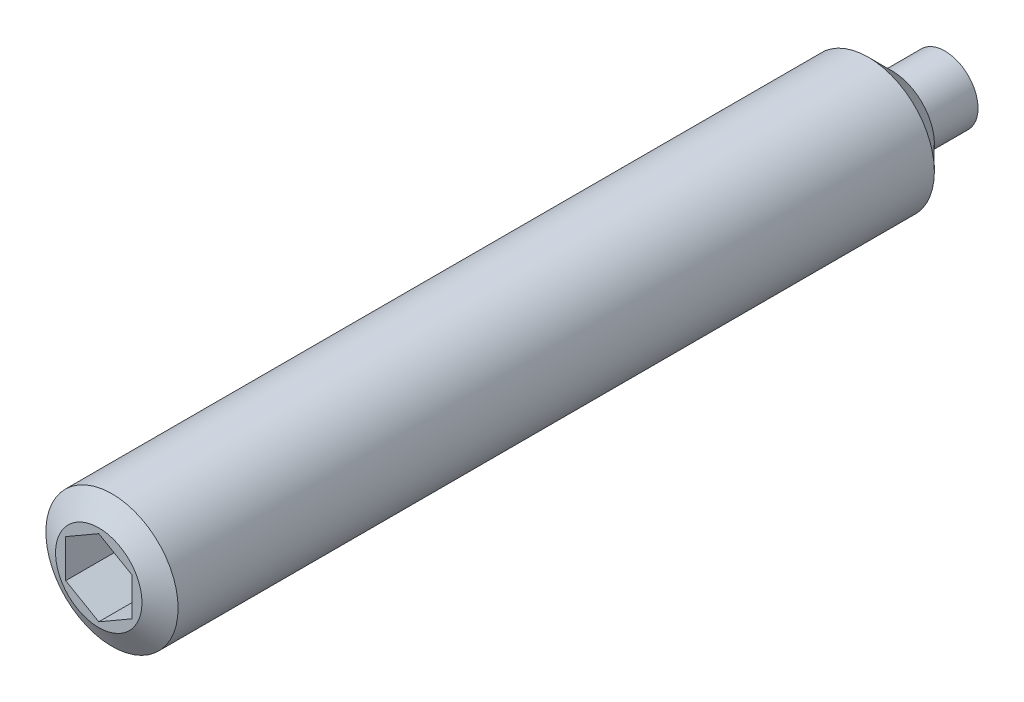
ISO-10303-21;
HEADER;
FILE_DESCRIPTION(('STEP AP214'),'2;1');
FILE_NAME('part.step','',(''),(''),'','','');
FILE_SCHEMA(('AUTOMOTIVE_DESIGN { 1 0 10303 214 1 1 1 1 }'));
ENDSEC;
DATA;
#1=APPLICATION_CONTEXT('core data for automotive mechanical design processes');
#2=APPLICATION_PROTOCOL_DEFINITION('international standard','automotive_design',2000,#1);
#3=PRODUCT_CONTEXT('',#1,'mechanical');
#4=PRODUCT('Part','Part','',(#3));
#5=PRODUCT_RELATED_PRODUCT_CATEGORY('part','',(#4));
#6=PRODUCT_DEFINITION_FORMATION('','',#4);
#7=PRODUCT_DEFINITION_CONTEXT('part definition',#1,'design');
#8=PRODUCT_DEFINITION('design','',#6,#7);
#9=PRODUCT_DEFINITION_SHAPE('','',#8);
#10=(LENGTH_UNIT() NAMED_UNIT(*) SI_UNIT(.MILLI.,.METRE.));
#11=(NAMED_UNIT(*) PLANE_ANGLE_UNIT() SI_UNIT($,.RADIAN.));
#12=(NAMED_UNIT(*) SI_UNIT($,.STERADIAN.) SOLID_ANGLE_UNIT());
#13=UNCERTAINTY_MEASURE_WITH_UNIT(LENGTH_MEASURE(1.E-05),#10,'distance_accuracy_value','');
#14=(GEOMETRIC_REPRESENTATION_CONTEXT(3) GLOBAL_UNCERTAINTY_ASSIGNED_CONTEXT((#13)) GLOBAL_UNIT_ASSIGNED_CONTEXT((#10,
#11,#12)) REPRESENTATION_CONTEXT('',''));
#15=CARTESIAN_POINT('',(0.,0.,0.));
#16=DIRECTION('',(0.,0.,1.));
#17=DIRECTION('',(1.,0.,0.));
#18=AXIS2_PLACEMENT_3D('',#15,#16,#17);
#19=CARTESIAN_POINT('',(1.25,0.,0.));
#20=DIRECTION('',(0.,0.,-1.));
#21=DIRECTION('',(-1.,0.,0.));
#22=AXIS2_PLACEMENT_3D('',#19,#20,#21);
#23=PLANE('',#22);
#24=CARTESIAN_POINT('',(0.,0.,0.));
#25=DIRECTION('',(0.,0.,1.));
#26=DIRECTION('',(1.,0.,0.));
#27=AXIS2_PLACEMENT_3D('',#24,#25,#26);
#28=CIRCLE('',#27,1.25);
#29=CARTESIAN_POINT('',(1.25,0.,0.));
#30=VERTEX_POINT('',#29);
#31=EDGE_CURVE('E124',#30,#30,#28,.T.);
#32=ORIENTED_EDGE('',*,*,#31,.F.);
#33=EDGE_LOOP('',(#32));
#34=FACE_BOUND('',#33,.T.);
#35=ADVANCED_FACE('F14',(#34),#23,.T.);
#36=CARTESIAN_POINT('',(0.,0.,52.));
#37=DIRECTION('',(0.,0.,1.));
#38=DIRECTION('',(1.,0.,0.));
#39=AXIS2_PLACEMENT_3D('',#36,#37,#38);
#40=CYLINDRICAL_SURFACE('',#39,1.25);
#41=CARTESIAN_POINT('',(0.,0.,2.));
#42=DIRECTION('',(0.,0.,1.));
#43=DIRECTION('',(1.,0.,0.));
#44=AXIS2_PLACEMENT_3D('',#41,#42,#43);
#45=CIRCLE('',#44,1.25);
#46=CARTESIAN_POINT('',(1.25,0.,2.));
#47=VERTEX_POINT('',#46);
#48=EDGE_CURVE('E121',#47,#47,#45,.T.);
#49=ORIENTED_EDGE('',*,*,#48,.F.);
#50=EDGE_LOOP('',(#49));
#51=FACE_BOUND('',#50,.T.);
#52=ORIENTED_EDGE('',*,*,#31,.T.);
#53=EDGE_LOOP('',(#52));
#54=FACE_BOUND('',#53,.T.);
#55=ADVANCED_FACE('F149',(#51,#54),#40,.T.);
#56=CARTESIAN_POINT('',(2.5,0.,2.));
#57=DIRECTION('',(0.,0.,-1.));
#58=DIRECTION('',(-1.,0.,0.));
#59=AXIS2_PLACEMENT_3D('',#56,#57,#58);
#60=PLANE('',#59);
#61=CARTESIAN_POINT('',(0.,0.,2.));
#62=DIRECTION('',(0.,0.,-1.));
#63=DIRECTION('',(-1.,0.,0.));
#64=AXIS2_PLACEMENT_3D('',#61,#62,#63);
#65=CIRCLE('',#64,1.6);
#66=CARTESIAN_POINT('',(-1.6,0.,2.));
#67=VERTEX_POINT('',#66);
#68=EDGE_CURVE('E130',#67,#67,#65,.T.);
#69=ORIENTED_EDGE('',*,*,#68,.T.);
#70=EDGE_LOOP('',(#69));
#71=FACE_BOUND('',#70,.T.);
#72=ORIENTED_EDGE('',*,*,#48,.T.);
#73=EDGE_LOOP('',(#72));
#74=FACE_BOUND('',#73,.T.);
#75=ADVANCED_FACE('F155',(#71,#74),#60,.T.);
#76=CARTESIAN_POINT('',(0.,0.,52.));
#77=DIRECTION('',(0.,0.,1.));
#78=DIRECTION('',(1.,0.,0.));
#79=AXIS2_PLACEMENT_3D('',#76,#77,#78);
#80=CYLINDRICAL_SURFACE('',#79,2.5);
#81=CARTESIAN_POINT('',(0.,0.,31.5));
#82=DIRECTION('',(0.,0.,1.));
#83=DIRECTION('',(1.,0.,0.));
#84=AXIS2_PLACEMENT_3D('',#81,#82,#83);
#85=CIRCLE('',#84,2.5);
#86=CARTESIAN_POINT('',(2.5,0.,31.5));
#87=VERTEX_POINT('',#86);
#88=EDGE_CURVE('E9',#87,#87,#85,.F.);
#89=ORIENTED_EDGE('',*,*,#88,.T.);
#90=EDGE_LOOP('',(#89));
#91=FACE_BOUND('',#90,.T.);
#92=CARTESIAN_POINT('',(0.,0.,2.9));
#93=DIRECTION('',(0.,0.,-1.));
#94=DIRECTION('',(-1.,0.,0.));
#95=AXIS2_PLACEMENT_3D('',#92,#93,#94);
#96=CIRCLE('',#95,2.5);
#97=CARTESIAN_POINT('',(-2.5,0.,2.9));
#98=VERTEX_POINT('',#97);
#99=EDGE_CURVE('E127',#98,#98,#96,.F.);
#100=ORIENTED_EDGE('',*,*,#99,.T.);
#101=EDGE_LOOP('',(#100));
#102=FACE_BOUND('',#101,.T.);
#103=ADVANCED_FACE('F162',(#91,#102),#80,.T.);
#104=CARTESIAN_POINT('',(0.,0.,32.));
#105=DIRECTION('',(0.,0.,1.));
#106=DIRECTION('',(1.,0.,0.));
#107=AXIS2_PLACEMENT_3D('',#104,#105,#106);
#108=PLANE('',#107);
#109=CARTESIAN_POINT('',(0.,0.,32.));
#110=DIRECTION('',(0.,0.,1.));
#111=DIRECTION('',(1.,0.,0.));
#112=AXIS2_PLACEMENT_3D('',#109,#110,#111);
#113=CIRCLE('',#112,1.63397459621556);
#114=CARTESIAN_POINT('',(1.63397459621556,0.,32.));
#115=VERTEX_POINT('',#114);
#116=EDGE_CURVE('E22',#115,#115,#113,.T.);
#117=ORIENTED_EDGE('',*,*,#116,.T.);
#118=EDGE_LOOP('',(#117));
#119=FACE_BOUND('',#118,.T.);
#120=DIRECTION('',(0.86602540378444,-0.5,0.));
#121=VECTOR('',#120,1.);
#122=CARTESIAN_POINT('',(-1.25,-0.721687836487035,32.));
#123=LINE('',#122,#121);
#124=CARTESIAN_POINT('',(-1.25,-0.721687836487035,32.));
#125=VERTEX_POINT('',#124);
#126=CARTESIAN_POINT('',(0.,-1.44337567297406,32.));
#127=VERTEX_POINT('',#126);
#128=EDGE_CURVE('E29',#125,#127,#123,.T.);
#129=ORIENTED_EDGE('',*,*,#128,.F.);
#130=DIRECTION('',(0.,-1.,0.));
#131=VECTOR('',#130,1.);
#132=CARTESIAN_POINT('',(-1.25,0.721687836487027,32.));
#133=LINE('',#132,#131);
#134=CARTESIAN_POINT('',(-1.25,0.721687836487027,32.));
#135=VERTEX_POINT('',#134);
#136=EDGE_CURVE('E97',#135,#125,#133,.T.);
#137=ORIENTED_EDGE('',*,*,#136,.F.);
#138=DIRECTION('',(0.866025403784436,0.5,0.));
#139=VECTOR('',#138,1.);
#140=CARTESIAN_POINT('',(-1.25,0.721687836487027,32.));
#141=LINE('',#140,#139);
#142=CARTESIAN_POINT('',(0.,1.44337567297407,32.));
#143=VERTEX_POINT('',#142);
#144=EDGE_CURVE('E92',#135,#143,#141,.T.);
#145=ORIENTED_EDGE('',*,*,#144,.T.);
#146=DIRECTION('',(-0.866025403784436,0.5,0.));
#147=VECTOR('',#146,1.);
#148=CARTESIAN_POINT('',(1.25,0.721687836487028,32.));
#149=LINE('',#148,#147);
#150=CARTESIAN_POINT('',(1.25,0.721687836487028,32.));
#151=VERTEX_POINT('',#150);
#152=EDGE_CURVE('E90',#151,#143,#149,.T.);
#153=ORIENTED_EDGE('',*,*,#152,.F.);
#154=DIRECTION('',(0.,-1.,0.));
#155=VECTOR('',#154,1.);
#156=CARTESIAN_POINT('',(1.25,0.721687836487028,32.));
#157=LINE('',#156,#155);
#158=CARTESIAN_POINT('',(1.25,-0.721687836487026,32.));
#159=VERTEX_POINT('',#158);
#160=EDGE_CURVE('E72',#151,#159,#157,.T.);
#161=ORIENTED_EDGE('',*,*,#160,.T.);
#162=DIRECTION('',(-0.866025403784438,-0.5,0.));
#163=VECTOR('',#162,1.);
#164=CARTESIAN_POINT('',(1.25,-0.721687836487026,32.));
#165=LINE('',#164,#163);
#166=EDGE_CURVE('E83',#159,#127,#165,.T.);
#167=ORIENTED_EDGE('',*,*,#166,.T.);
#168=EDGE_LOOP('',(#129,#137,#145,#153,#161,#167));
#169=FACE_BOUND('',#168,.T.);
#170=ADVANCED_FACE('F87',(#119,#169),#108,.T.);
#171=CARTESIAN_POINT('',(-1.25,-0.721687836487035,29.5));
#172=DIRECTION('',(-0.5,-0.86602540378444,0.));
#173=DIRECTION('',(-0.86602540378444,0.5,0.));
#174=AXIS2_PLACEMENT_3D('',#171,#172,#173);
#175=PLANE('',#174);
#176=DIRECTION('',(0.,0.,1.));
#177=VECTOR('',#176,1.);
#178=CARTESIAN_POINT('',(-1.25,-0.721687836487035,29.5));
#179=LINE('',#178,#177);
#180=CARTESIAN_POINT('',(-1.25,-0.721687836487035,29.5));
#181=VERTEX_POINT('',#180);
#182=EDGE_CURVE('E36',#181,#125,#179,.T.);
#183=ORIENTED_EDGE('',*,*,#182,.T.);
#184=ORIENTED_EDGE('',*,*,#128,.T.);
#185=DIRECTION('',(0.,0.,1.));
#186=VECTOR('',#185,1.);
#187=CARTESIAN_POINT('',(0.,-1.44337567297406,29.5));
#188=LINE('',#187,#186);
#189=CARTESIAN_POINT('',(0.,-1.44337567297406,29.5));
#190=VERTEX_POINT('',#189);
#191=EDGE_CURVE('E80',#190,#127,#188,.T.);
#192=ORIENTED_EDGE('',*,*,#191,.F.);
#193=DIRECTION('',(0.86602540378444,-0.5,0.));
#194=VECTOR('',#193,1.);
#195=CARTESIAN_POINT('',(-1.25,-0.721687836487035,29.5));
#196=LINE('',#195,#194);
#197=EDGE_CURVE('E99',#181,#190,#196,.T.);
#198=ORIENTED_EDGE('',*,*,#197,.F.);
#199=EDGE_LOOP('',(#183,#184,#192,#198));
#200=FACE_BOUND('',#199,.T.);
#201=ADVANCED_FACE('F169',(#200),#175,.F.);
#202=CARTESIAN_POINT('',(-1.25,0.721687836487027,29.5));
#203=DIRECTION('',(-1.,0.,0.));
#204=DIRECTION('',(0.,1.,0.));
#205=AXIS2_PLACEMENT_3D('',#202,#203,#204);
#206=PLANE('',#205);
#207=DIRECTION('',(0.,0.,1.));
#208=VECTOR('',#207,1.);
#209=CARTESIAN_POINT('',(-1.25,0.721687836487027,29.5));
#210=LINE('',#209,#208);
#211=CARTESIAN_POINT('',(-1.25,0.721687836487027,29.5));
#212=VERTEX_POINT('',#211);
#213=EDGE_CURVE('E118',#212,#135,#210,.T.);
#214=ORIENTED_EDGE('',*,*,#213,.T.);
#215=ORIENTED_EDGE('',*,*,#136,.T.);
#216=ORIENTED_EDGE('',*,*,#182,.F.);
#217=DIRECTION('',(0.,-1.,0.));
#218=VECTOR('',#217,1.);
#219=CARTESIAN_POINT('',(-1.25,0.721687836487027,29.5));
#220=LINE('',#219,#218);
#221=EDGE_CURVE('E111',#212,#181,#220,.T.);
#222=ORIENTED_EDGE('',*,*,#221,.F.);
#223=EDGE_LOOP('',(#214,#215,#216,#222));
#224=FACE_BOUND('',#223,.T.);
#225=ADVANCED_FACE('F170',(#224),#206,.F.);
#226=CARTESIAN_POINT('',(-1.25,0.721687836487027,29.5));
#227=DIRECTION('',(0.5,-0.866025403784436,0.));
#228=DIRECTION('',(-0.866025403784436,-0.5,0.));
#229=AXIS2_PLACEMENT_3D('',#226,#227,#228);
#230=PLANE('',#229);
#231=DIRECTION('',(0.,0.,1.));
#232=VECTOR('',#231,1.);
#233=CARTESIAN_POINT('',(0.,1.44337567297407,29.5));
#234=LINE('',#233,#232);
#235=CARTESIAN_POINT('',(0.,1.44337567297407,29.5));
#236=VERTEX_POINT('',#235);
#237=EDGE_CURVE('E116',#236,#143,#234,.T.);
#238=ORIENTED_EDGE('',*,*,#237,.T.);
#239=ORIENTED_EDGE('',*,*,#144,.F.);
#240=ORIENTED_EDGE('',*,*,#213,.F.);
#241=DIRECTION('',(0.866025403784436,0.5,0.));
#242=VECTOR('',#241,1.);
#243=CARTESIAN_POINT('',(-1.25,0.721687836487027,29.5));
#244=LINE('',#243,#242);
#245=EDGE_CURVE('E108',#212,#236,#244,.T.);
#246=ORIENTED_EDGE('',*,*,#245,.T.);
#247=EDGE_LOOP('',(#238,#239,#240,#246));
#248=FACE_BOUND('',#247,.T.);
#249=ADVANCED_FACE('F173',(#248),#230,.T.);
#250=CARTESIAN_POINT('',(1.25,0.721687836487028,29.5));
#251=DIRECTION('',(0.5,0.866025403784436,0.));
#252=DIRECTION('',(0.866025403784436,-0.5,0.));
#253=AXIS2_PLACEMENT_3D('',#250,#251,#252);
#254=PLANE('',#253);
#255=DIRECTION('',(0.,0.,1.));
#256=VECTOR('',#255,1.);
#257=CARTESIAN_POINT('',(1.25,0.721687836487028,29.5));
#258=LINE('',#257,#256);
#259=CARTESIAN_POINT('',(1.25,0.721687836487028,29.5));
#260=VERTEX_POINT('',#259);
#261=EDGE_CURVE('E79',#260,#151,#258,.T.);
#262=ORIENTED_EDGE('',*,*,#261,.T.);
#263=ORIENTED_EDGE('',*,*,#152,.T.);
#264=ORIENTED_EDGE('',*,*,#237,.F.);
#265=DIRECTION('',(-0.866025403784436,0.5,0.));
#266=VECTOR('',#265,1.);
#267=CARTESIAN_POINT('',(1.25,0.721687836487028,29.5));
#268=LINE('',#267,#266);
#269=EDGE_CURVE('E105',#260,#236,#268,.T.);
#270=ORIENTED_EDGE('',*,*,#269,.F.);
#271=EDGE_LOOP('',(#262,#263,#264,#270));
#272=FACE_BOUND('',#271,.T.);
#273=ADVANCED_FACE('F176',(#272),#254,.F.);
#274=CARTESIAN_POINT('',(1.25,0.721687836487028,29.5));
#275=DIRECTION('',(-1.,0.,0.));
#276=DIRECTION('',(0.,1.,0.));
#277=AXIS2_PLACEMENT_3D('',#274,#275,#276);
#278=PLANE('',#277);
#279=DIRECTION('',(0.,0.,1.));
#280=VECTOR('',#279,1.);
#281=CARTESIAN_POINT('',(1.25,-0.721687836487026,29.5));
#282=LINE('',#281,#280);
#283=CARTESIAN_POINT('',(1.25,-0.721687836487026,29.5));
#284=VERTEX_POINT('',#283);
#285=EDGE_CURVE('E68',#284,#159,#282,.T.);
#286=ORIENTED_EDGE('',*,*,#285,.T.);
#287=ORIENTED_EDGE('',*,*,#160,.F.);
#288=ORIENTED_EDGE('',*,*,#261,.F.);
#289=DIRECTION('',(0.,-1.,0.));
#290=VECTOR('',#289,1.);
#291=CARTESIAN_POINT('',(1.25,0.721687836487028,29.5));
#292=LINE('',#291,#290);
#293=EDGE_CURVE('E75',#260,#284,#292,.T.);
#294=ORIENTED_EDGE('',*,*,#293,.T.);
#295=EDGE_LOOP('',(#286,#287,#288,#294));
#296=FACE_BOUND('',#295,.T.);
#297=ADVANCED_FACE('F70',(#296),#278,.T.);
#298=CARTESIAN_POINT('',(1.25,-0.721687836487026,29.5));
#299=DIRECTION('',(-0.5,0.866025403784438,0.));
#300=DIRECTION('',(0.866025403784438,0.5,0.));
#301=AXIS2_PLACEMENT_3D('',#298,#299,#300);
#302=PLANE('',#301);
#303=DIRECTION('',(-0.866025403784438,-0.5,0.));
#304=VECTOR('',#303,1.);
#305=CARTESIAN_POINT('',(1.25,-0.721687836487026,29.5));
#306=LINE('',#305,#304);
#307=EDGE_CURVE('E102',#284,#190,#306,.T.);
#308=ORIENTED_EDGE('',*,*,#307,.T.);
#309=ORIENTED_EDGE('',*,*,#191,.T.);
#310=ORIENTED_EDGE('',*,*,#166,.F.);
#311=ORIENTED_EDGE('',*,*,#285,.F.);
#312=EDGE_LOOP('',(#308,#309,#310,#311));
#313=FACE_BOUND('',#312,.T.);
#314=ADVANCED_FACE('F84',(#313),#302,.T.);
#315=CARTESIAN_POINT('',(1.25,-2.16506350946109,29.5));
#316=DIRECTION('',(0.,0.,-1.));
#317=DIRECTION('',(-1.,0.,0.));
#318=AXIS2_PLACEMENT_3D('',#315,#316,#317);
#319=PLANE('',#318);
#320=ORIENTED_EDGE('',*,*,#197,.T.);
#321=ORIENTED_EDGE('',*,*,#307,.F.);
#322=ORIENTED_EDGE('',*,*,#293,.F.);
#323=ORIENTED_EDGE('',*,*,#269,.T.);
#324=ORIENTED_EDGE('',*,*,#245,.F.);
#325=ORIENTED_EDGE('',*,*,#221,.T.);
#326=EDGE_LOOP('',(#320,#321,#322,#323,#324,#325));
#327=FACE_BOUND('',#326,.T.);
#328=ADVANCED_FACE('F144',(#327),#319,.F.);
#329=CARTESIAN_POINT('',(0.,0.,2.9));
#330=DIRECTION('',(0.,0.,1.));
#331=DIRECTION('',(1.,0.,0.));
#332=AXIS2_PLACEMENT_3D('',#329,#330,#331);
#333=CONICAL_SURFACE('',#332,2.5,0.785398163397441);
#334=ORIENTED_EDGE('',*,*,#68,.F.);
#335=EDGE_LOOP('',(#334));
#336=FACE_BOUND('',#335,.T.);
#337=ORIENTED_EDGE('',*,*,#99,.F.);
#338=EDGE_LOOP('',(#337));
#339=FACE_BOUND('',#338,.T.);
#340=ADVANCED_FACE('F137',(#336,#339),#333,.T.);
#341=CARTESIAN_POINT('',(0.,0.,32.));
#342=DIRECTION('',(0.,0.,-1.));
#343=DIRECTION('',(-1.,0.,0.));
#344=AXIS2_PLACEMENT_3D('',#341,#342,#343);
#345=CONICAL_SURFACE('',#344,1.63397459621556,1.0471975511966);
#346=ORIENTED_EDGE('',*,*,#88,.F.);
#347=EDGE_LOOP('',(#346));
#348=FACE_BOUND('',#347,.T.);
#349=ORIENTED_EDGE('',*,*,#116,.F.);
#350=EDGE_LOOP('',(#349));
#351=FACE_BOUND('',#350,.T.);
#352=ADVANCED_FACE('F16',(#348,#351),#345,.T.);
#353=CLOSED_SHELL('',(#35,#55,#75,#103,#170,#201,#225,#249,#273,#297,#314,#328,#340,#352));
#354=MANIFOLD_SOLID_BREP('B1',#353);
#355=ADVANCED_BREP_SHAPE_REPRESENTATION('',(#18,#354),#14);
#356=SHAPE_DEFINITION_REPRESENTATION(#9,#355);
ENDSEC;
END-ISO-10303-21;
